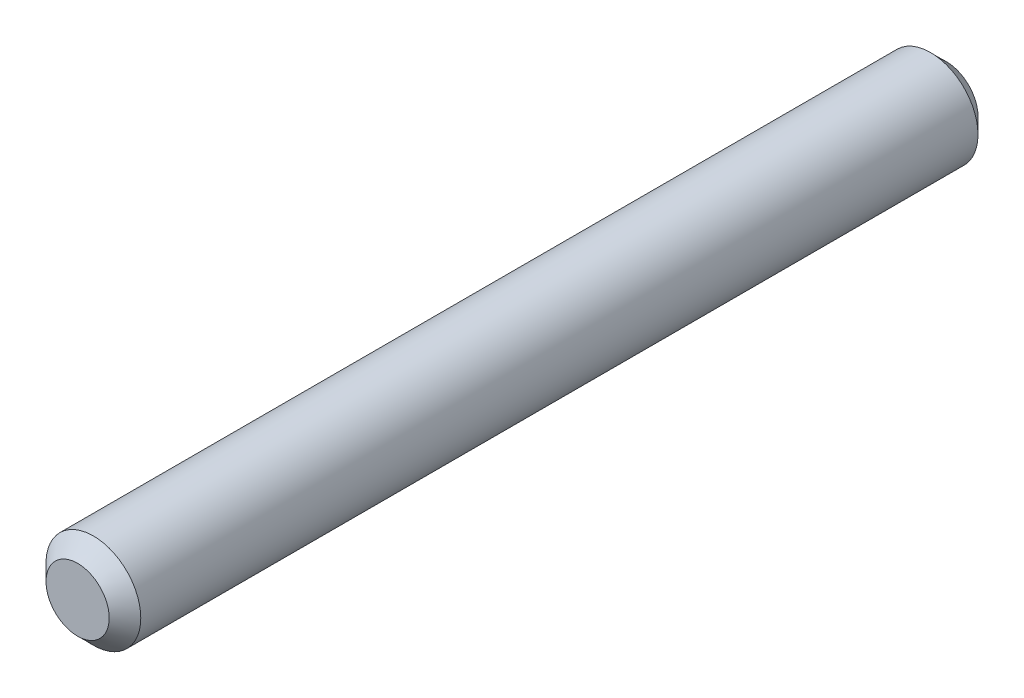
from build123d import *

# Parameters (mm, degrees)
ESQUISSE1_R          = 3
BASE_EXTRUSION_DEPTH = 55
CHANFREIN1_SIZE      = 1


with BuildPart() as part:
    # Esquisse1 → Base-Extrusion (new body)
    with BuildSketch(Plane.XY):
        Circle(ESQUISSE1_R)
    extrude(amount=-BASE_EXTRUSION_DEPTH)

    # Chanfrein1
    chanfrein1_edges = [part.edges().sort_by_distance(p)[0] for p in [
        (-3, 0, 0),
        (-3, 0, -55),
    ]]
    chamfer(chanfrein1_edges, length=CHANFREIN1_SIZE)


solid = part.part
